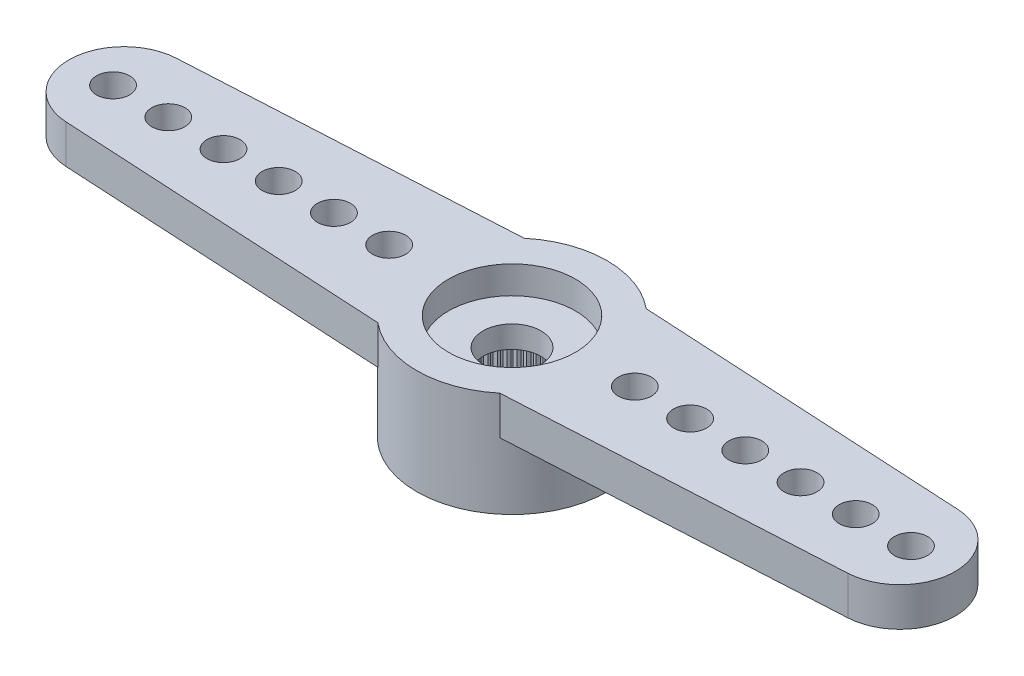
from build123d import *

# Parameters (mm, degrees)
RESSALTO_EXTRUS_O1_DEPTH = 1.4
ESBO_O2_R                = 3.45
RESSALTO_EXTRUS_O2_DEPTH = 2.4
FURO4_D                  = 1.2
PADR_O_LINEAR1_COUNT     = 6
PADR_O_LINEAR1_PITCH     = 2
PADR_OCIRCULAR2_COUNT    = 2
PADR_OCIRCULAR2_COPY_1_D = 1.2
PADR_OCIRCULAR2_COPY_2_D = 1.2
PADR_OCIRCULAR2_COPY_3_D = 1.2
PADR_OCIRCULAR2_COPY_4_D = 1.2
PADR_OCIRCULAR2_COPY_5_D = 1.2
FURO1_D                  = 4.95
FURO1_DEPTH              = 2
FURO2_D                  = 4.6
FURO2_DEPTH              = 1
FURO3_D                  = 2.1
RESSALTO_EXTRUS_O3_START = -2
RESSALTO_EXTRUS_O3_DEPTH = 2
PADR_OCIRCULAR1_COUNT    = 60


with BuildPart() as part:
    # Esbo_o1 → Ressalto-extrus_o1 (new body)
    with BuildSketch(Plane(origin=(0, 0, 0), x_dir=(1, 0, 0), z_dir=(0, 1, 0))):
        with BuildLine():
            Line((-14.159121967, 1.99702088), (-2.209072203, 2.65))
            ThreePointArc((-2.209072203, 2.65), (3.45, 0), (-2.209072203, -2.65))
            Line((-2.209072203, -2.65), (-14.159121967, -1.99702088))
            ThreePointArc((-14.159121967, -1.99702088), (-16.05, 0), (-14.159121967, 1.99702088))
        make_face()
    ressalto_extrus_o1 = extrude(amount=-RESSALTO_EXTRUS_O1_DEPTH)

    # Esbo_o2 → Ressalto-extrus_o2 (add)
    with BuildSketch(Plane.XZ.offset(1.4)):
        with Locations(Location((0, 0, 0), (0, 0, 90))):
            Circle(ESBO_O2_R)
    extrude(amount=RESSALTO_EXTRUS_O2_DEPTH)

    # Furo4 (through all)
    with Locations(Plane(origin=(0, 0, 0), x_dir=(1, 0, 0), z_dir=(0, 1, 0))):
        with Locations((-14.45, 0)):
            furo4 = Hole(FURO4_D / 2)

    # Padr_o linear1: Furo4 ×6
    with Locations(*[(i * PADR_O_LINEAR1_PITCH, 0, 0) for i in range(1, PADR_O_LINEAR1_COUNT)]):
        add(furo4, mode=Mode.SUBTRACT)

    # Padr_oCircular2: Ressalto-extrus_o1, Furo4 ×2 about axis
    padr_ocircular2_axis = Axis((0, 0, 0), (0, 1, 0))
    add([ressalto_extrus_o1.rotate(padr_ocircular2_axis, i * 360 / PADR_OCIRCULAR2_COUNT) for i in range(1, PADR_OCIRCULAR2_COUNT)])
    add([furo4.rotate(padr_ocircular2_axis, i * 360 / PADR_OCIRCULAR2_COUNT) for i in range(1, PADR_OCIRCULAR2_COUNT)], mode=Mode.SUBTRACT)

    # Padr_oCircular2 copy 1 (through all)
    with Locations(Plane(origin=(-2, 0, 0), x_dir=(-1, 0, 0), z_dir=(0, 1, 0))):
        with Locations((-14.45, 0)):
            Hole(PADR_OCIRCULAR2_COPY_1_D / 2)

    # Padr_oCircular2 copy 2 (through all)
    with Locations(Plane(origin=(-4, 0, 0), x_dir=(-1, 0, 0), z_dir=(0, 1, 0))):
        with Locations((-14.45, 0)):
            Hole(PADR_OCIRCULAR2_COPY_2_D / 2)

    # Padr_oCircular2 copy 3 (through all)
    with Locations(Plane(origin=(-6, 0, 0), x_dir=(-1, 0, 0), z_dir=(0, 1, 0))):
        with Locations((-14.45, 0)):
            Hole(PADR_OCIRCULAR2_COPY_3_D / 2)

    # Padr_oCircular2 copy 4 (through all)
    with Locations(Plane(origin=(-8, 0, 0), x_dir=(-1, 0, 0), z_dir=(0, 1, 0))):
        with Locations((-14.45, 0)):
            Hole(PADR_OCIRCULAR2_COPY_4_D / 2)

    # Padr_oCircular2 copy 5 (through all)
    with Locations(Plane(origin=(-10, 0, 0), x_dir=(-1, 0, 0), z_dir=(0, 1, 0))):
        with Locations((-14.45, 0)):
            Hole(PADR_OCIRCULAR2_COPY_5_D / 2)

    # Furo1
    with Locations(Plane(origin=(0, -3.8, 0), x_dir=(-1, 0, 0), z_dir=(0, -1, 0))):
        with Locations((0, 0)):
            Hole(FURO1_D / 2, depth=FURO1_DEPTH)

    # Furo2
    with Locations(Plane(origin=(0, 0, 0), x_dir=(1, 0, 0), z_dir=(0, 1, 0))):
        with Locations((0, 0)):
            Hole(FURO2_D / 2, depth=FURO2_DEPTH)

    # Furo3 (through all)
    with Locations(Plane(origin=(0, 0, 0), x_dir=(1, 0, 0), z_dir=(0, 1, 0))):
        with Locations((0, 0)):
            Hole(FURO3_D / 2)

    # Esbo_o11 → Ressalto-extrus_o3 (add)
    with BuildSketch(Plane.XZ.offset(3.8).offset(RESSALTO_EXTRUS_O3_START)):
        with BuildLine():
            Line((-0.098056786, 2.473056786), (0, 2.375))
            Line((0, 2.375), (0.098056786, 2.473056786))
            ThreePointArc((0.098056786, 2.473056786), (0, 2.475), (-0.098056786, 2.473056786))
        make_face()
    ressalto_extrus_o3 = extrude(amount=RESSALTO_EXTRUS_O3_DEPTH)

    # Padr_oCircular1: Ressalto-extrus_o3 ×60 about axis
    padr_ocircular1_axis = Axis((0, 0, 0), (0, 1, 0))
    for i in range(1, PADR_OCIRCULAR1_COUNT):
        add(ressalto_extrus_o3.rotate(padr_ocircular1_axis, i * 360 / PADR_OCIRCULAR1_COUNT))


solid = part.part
